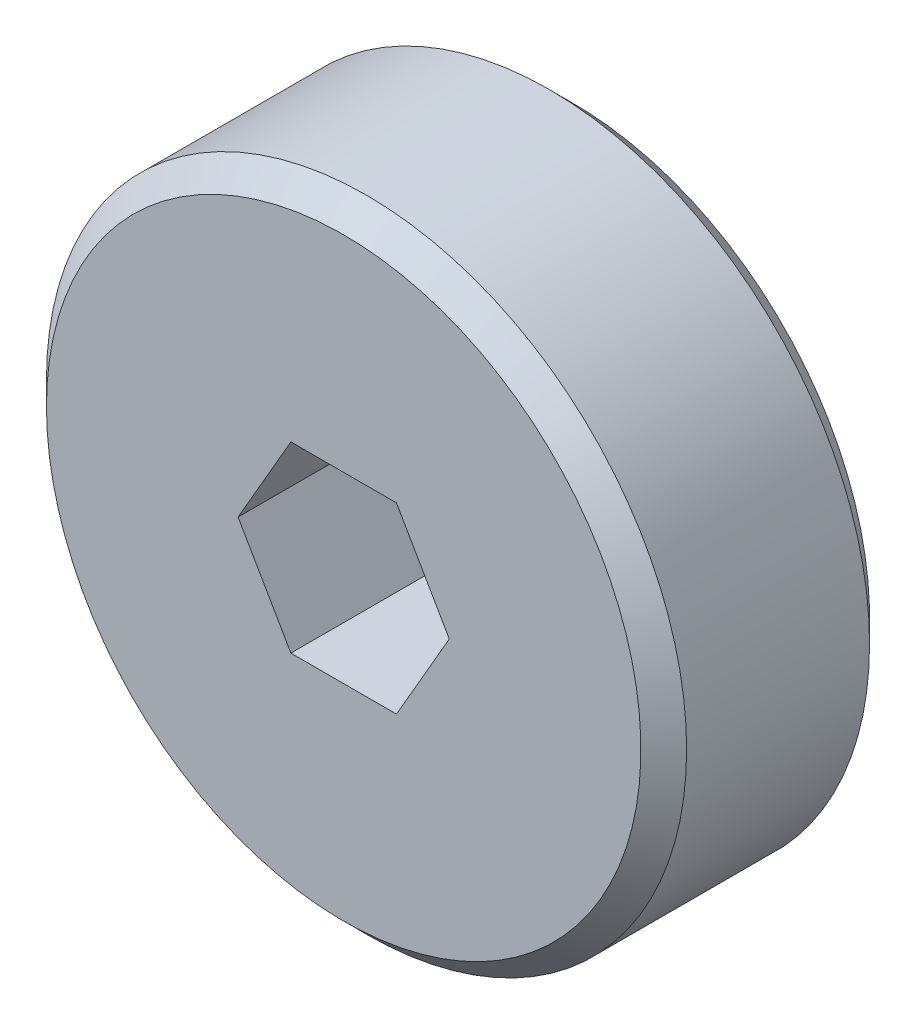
ISO-10303-21;
HEADER;
FILE_DESCRIPTION(('STEP AP214'),'2;1');
FILE_NAME('part.step','',(''),(''),'','','');
FILE_SCHEMA(('AUTOMOTIVE_DESIGN { 1 0 10303 214 1 1 1 1 }'));
ENDSEC;
DATA;
#1=APPLICATION_CONTEXT('core data for automotive mechanical design processes');
#2=APPLICATION_PROTOCOL_DEFINITION('international standard','automotive_design',2000,#1);
#3=PRODUCT_CONTEXT('',#1,'mechanical');
#4=PRODUCT('Part','Part','',(#3));
#5=PRODUCT_RELATED_PRODUCT_CATEGORY('part','',(#4));
#6=PRODUCT_DEFINITION_FORMATION('','',#4);
#7=PRODUCT_DEFINITION_CONTEXT('part definition',#1,'design');
#8=PRODUCT_DEFINITION('design','',#6,#7);
#9=PRODUCT_DEFINITION_SHAPE('','',#8);
#10=(LENGTH_UNIT() NAMED_UNIT(*) SI_UNIT(.MILLI.,.METRE.));
#11=(NAMED_UNIT(*) PLANE_ANGLE_UNIT() SI_UNIT($,.RADIAN.));
#12=(NAMED_UNIT(*) SI_UNIT($,.STERADIAN.) SOLID_ANGLE_UNIT());
#13=UNCERTAINTY_MEASURE_WITH_UNIT(LENGTH_MEASURE(1.E-05),#10,'distance_accuracy_value','');
#14=(GEOMETRIC_REPRESENTATION_CONTEXT(3) GLOBAL_UNCERTAINTY_ASSIGNED_CONTEXT((#13)) GLOBAL_UNIT_ASSIGNED_CONTEXT((#10,
#11,#12)) REPRESENTATION_CONTEXT('',''));
#15=CARTESIAN_POINT('',(0.,0.,0.));
#16=DIRECTION('',(0.,0.,1.));
#17=DIRECTION('',(1.,0.,0.));
#18=AXIS2_PLACEMENT_3D('',#15,#16,#17);
#19=CARTESIAN_POINT('',(0.,0.,0.));
#20=DIRECTION('',(0.,0.,1.));
#21=DIRECTION('',(1.,0.,0.));
#22=AXIS2_PLACEMENT_3D('',#19,#20,#21);
#23=PLANE('',#22);
#24=DIRECTION('',(-0.5,-0.866025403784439,0.));
#25=VECTOR('',#24,1.);
#26=CARTESIAN_POINT('',(3.66617420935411,0.,0.));
#27=LINE('',#26,#25);
#28=CARTESIAN_POINT('',(3.66617420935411,0.,0.));
#29=VERTEX_POINT('',#28);
#30=CARTESIAN_POINT('',(1.83308710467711,-3.175,0.));
#31=VERTEX_POINT('',#30);
#32=EDGE_CURVE('E147',#29,#31,#27,.T.);
#33=ORIENTED_EDGE('',*,*,#32,.F.);
#34=DIRECTION('',(0.5,-0.866025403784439,0.));
#35=VECTOR('',#34,1.);
#36=CARTESIAN_POINT('',(1.83308710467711,3.175,0.));
#37=LINE('',#36,#35);
#38=CARTESIAN_POINT('',(1.83308710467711,3.175,0.));
#39=VERTEX_POINT('',#38);
#40=EDGE_CURVE('E66',#39,#29,#37,.T.);
#41=ORIENTED_EDGE('',*,*,#40,.F.);
#42=DIRECTION('',(1.,0.,0.));
#43=VECTOR('',#42,1.);
#44=CARTESIAN_POINT('',(-1.83308710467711,3.175,0.));
#45=LINE('',#44,#43);
#46=CARTESIAN_POINT('',(-1.83308710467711,3.175,0.));
#47=VERTEX_POINT('',#46);
#48=EDGE_CURVE('E126',#47,#39,#45,.T.);
#49=ORIENTED_EDGE('',*,*,#48,.F.);
#50=DIRECTION('',(0.5,0.866025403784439,0.));
#51=VECTOR('',#50,1.);
#52=CARTESIAN_POINT('',(-3.66617420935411,0.,0.));
#53=LINE('',#52,#51);
#54=CARTESIAN_POINT('',(-3.66617420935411,0.,0.));
#55=VERTEX_POINT('',#54);
#56=EDGE_CURVE('E131',#55,#47,#53,.T.);
#57=ORIENTED_EDGE('',*,*,#56,.F.);
#58=DIRECTION('',(-0.5,0.866025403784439,0.));
#59=VECTOR('',#58,1.);
#60=CARTESIAN_POINT('',(-1.83308710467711,-3.175,0.));
#61=LINE('',#60,#59);
#62=CARTESIAN_POINT('',(-1.83308710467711,-3.175,0.));
#63=VERTEX_POINT('',#62);
#64=EDGE_CURVE('E154',#63,#55,#61,.T.);
#65=ORIENTED_EDGE('',*,*,#64,.F.);
#66=DIRECTION('',(-1.,0.,0.));
#67=VECTOR('',#66,1.);
#68=CARTESIAN_POINT('',(1.83308710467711,-3.175,0.));
#69=LINE('',#68,#67);
#70=EDGE_CURVE('E150',#31,#63,#69,.T.);
#71=ORIENTED_EDGE('',*,*,#70,.F.);
#72=EDGE_LOOP('',(#33,#41,#49,#57,#65,#71));
#73=FACE_BOUND('',#72,.T.);
#74=CARTESIAN_POINT('',(0.,0.,0.));
#75=DIRECTION('',(0.,0.,-1.));
#76=DIRECTION('',(-1.,0.,0.));
#77=AXIS2_PLACEMENT_3D('',#74,#75,#76);
#78=CIRCLE('',#77,10.31875);
#79=CARTESIAN_POINT('',(-10.31875,0.,0.));
#80=VERTEX_POINT('',#79);
#81=EDGE_CURVE('E11',#80,#80,#78,.T.);
#82=ORIENTED_EDGE('',*,*,#81,.T.);
#83=EDGE_LOOP('',(#82));
#84=FACE_BOUND('',#83,.T.);
#85=ADVANCED_FACE('F51',(#73,#84),#23,.F.);
#86=CARTESIAN_POINT('',(0.,0.,0.793749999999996));
#87=DIRECTION('',(0.,0.,1.));
#88=DIRECTION('',(1.,0.,0.));
#89=AXIS2_PLACEMENT_3D('',#86,#87,#88);
#90=CONICAL_SURFACE('',#89,11.1125,0.78539816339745);
#91=ORIENTED_EDGE('',*,*,#81,.F.);
#92=EDGE_LOOP('',(#91));
#93=FACE_BOUND('',#92,.T.);
#94=CARTESIAN_POINT('',(0.,0.,0.793749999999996));
#95=DIRECTION('',(0.,0.,-1.));
#96=DIRECTION('',(-1.,0.,0.));
#97=AXIS2_PLACEMENT_3D('',#94,#95,#96);
#98=CIRCLE('',#97,11.1125);
#99=CARTESIAN_POINT('',(-11.1125,0.,0.793749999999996));
#100=VERTEX_POINT('',#99);
#101=EDGE_CURVE('E59',#100,#100,#98,.T.);
#102=ORIENTED_EDGE('',*,*,#101,.T.);
#103=EDGE_LOOP('',(#102));
#104=FACE_BOUND('',#103,.T.);
#105=ADVANCED_FACE('F187',(#93,#104),#90,.T.);
#106=CARTESIAN_POINT('',(0.,0.,-10.585154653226));
#107=DIRECTION('',(0.,0.,-1.));
#108=DIRECTION('',(-1.,0.,0.));
#109=AXIS2_PLACEMENT_3D('',#106,#107,#108);
#110=CYLINDRICAL_SURFACE('',#109,11.1125);
#111=ORIENTED_EDGE('',*,*,#101,.F.);
#112=EDGE_LOOP('',(#111));
#113=FACE_BOUND('',#112,.T.);
#114=CARTESIAN_POINT('',(0.,0.,7.14374999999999));
#115=DIRECTION('',(0.,0.,-1.));
#116=DIRECTION('',(-1.,0.,0.));
#117=AXIS2_PLACEMENT_3D('',#114,#115,#116);
#118=CIRCLE('',#117,11.1125);
#119=CARTESIAN_POINT('',(-11.1125,0.,7.14374999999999));
#120=VERTEX_POINT('',#119);
#121=EDGE_CURVE('E179',#120,#120,#118,.T.);
#122=ORIENTED_EDGE('',*,*,#121,.T.);
#123=EDGE_LOOP('',(#122));
#124=FACE_BOUND('',#123,.T.);
#125=ADVANCED_FACE('F189',(#113,#124),#110,.T.);
#126=CARTESIAN_POINT('',(0.,0.,7.9375));
#127=DIRECTION('',(0.,0.,-1.));
#128=DIRECTION('',(-1.,0.,0.));
#129=AXIS2_PLACEMENT_3D('',#126,#127,#128);
#130=CONICAL_SURFACE('',#129,10.31875,0.785398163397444);
#131=ORIENTED_EDGE('',*,*,#121,.F.);
#132=EDGE_LOOP('',(#131));
#133=FACE_BOUND('',#132,.T.);
#134=CARTESIAN_POINT('',(0.,0.,7.9375));
#135=DIRECTION('',(0.,0.,-1.));
#136=DIRECTION('',(-1.,0.,0.));
#137=AXIS2_PLACEMENT_3D('',#134,#135,#136);
#138=CIRCLE('',#137,10.31875);
#139=CARTESIAN_POINT('',(-10.31875,0.,7.9375));
#140=VERTEX_POINT('',#139);
#141=EDGE_CURVE('E164',#140,#140,#138,.T.);
#142=ORIENTED_EDGE('',*,*,#141,.T.);
#143=EDGE_LOOP('',(#142));
#144=FACE_BOUND('',#143,.T.);
#145=ADVANCED_FACE('F192',(#133,#144),#130,.T.);
#146=CARTESIAN_POINT('',(-10.31875,0.,7.9375));
#147=DIRECTION('',(0.,0.,-1.));
#148=DIRECTION('',(-1.,0.,0.));
#149=AXIS2_PLACEMENT_3D('',#146,#147,#148);
#150=PLANE('',#149);
#151=DIRECTION('',(1.,0.,0.));
#152=VECTOR('',#151,1.);
#153=CARTESIAN_POINT('',(-1.83308710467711,3.175,7.9375));
#154=LINE('',#153,#152);
#155=CARTESIAN_POINT('',(-1.83308710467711,3.175,7.9375));
#156=VERTEX_POINT('',#155);
#157=CARTESIAN_POINT('',(1.83308710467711,3.175,7.9375));
#158=VERTEX_POINT('',#157);
#159=EDGE_CURVE('E113',#156,#158,#154,.T.);
#160=ORIENTED_EDGE('',*,*,#159,.T.);
#161=DIRECTION('',(0.5,-0.866025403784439,0.));
#162=VECTOR('',#161,1.);
#163=CARTESIAN_POINT('',(1.83308710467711,3.175,7.9375));
#164=LINE('',#163,#162);
#165=CARTESIAN_POINT('',(3.66617420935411,0.,7.9375));
#166=VERTEX_POINT('',#165);
#167=EDGE_CURVE('E106',#158,#166,#164,.T.);
#168=ORIENTED_EDGE('',*,*,#167,.T.);
#169=DIRECTION('',(-0.5,-0.866025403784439,0.));
#170=VECTOR('',#169,1.);
#171=CARTESIAN_POINT('',(3.66617420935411,0.,7.9375));
#172=LINE('',#171,#170);
#173=CARTESIAN_POINT('',(1.83308710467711,-3.175,7.9375));
#174=VERTEX_POINT('',#173);
#175=EDGE_CURVE('E116',#166,#174,#172,.T.);
#176=ORIENTED_EDGE('',*,*,#175,.T.);
#177=DIRECTION('',(-1.,0.,0.));
#178=VECTOR('',#177,1.);
#179=CARTESIAN_POINT('',(1.83308710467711,-3.175,7.9375));
#180=LINE('',#179,#178);
#181=CARTESIAN_POINT('',(-1.83308710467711,-3.175,7.9375));
#182=VERTEX_POINT('',#181);
#183=EDGE_CURVE('E74',#174,#182,#180,.T.);
#184=ORIENTED_EDGE('',*,*,#183,.T.);
#185=DIRECTION('',(-0.5,0.866025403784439,0.));
#186=VECTOR('',#185,1.);
#187=CARTESIAN_POINT('',(-1.83308710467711,-3.175,7.9375));
#188=LINE('',#187,#186);
#189=CARTESIAN_POINT('',(-3.66617420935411,0.,7.9375));
#190=VERTEX_POINT('',#189);
#191=EDGE_CURVE('E136',#182,#190,#188,.T.);
#192=ORIENTED_EDGE('',*,*,#191,.T.);
#193=DIRECTION('',(0.5,0.866025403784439,0.));
#194=VECTOR('',#193,1.);
#195=CARTESIAN_POINT('',(-3.66617420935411,0.,7.9375));
#196=LINE('',#195,#194);
#197=EDGE_CURVE('E140',#190,#156,#196,.T.);
#198=ORIENTED_EDGE('',*,*,#197,.T.);
#199=EDGE_LOOP('',(#160,#168,#176,#184,#192,#198));
#200=FACE_BOUND('',#199,.T.);
#201=ORIENTED_EDGE('',*,*,#141,.F.);
#202=EDGE_LOOP('',(#201));
#203=FACE_BOUND('',#202,.T.);
#204=ADVANCED_FACE('F121',(#200,#203),#150,.F.);
#205=CARTESIAN_POINT('',(1.83308710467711,3.175,7.9375));
#206=DIRECTION('',(0.866025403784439,0.5,0.));
#207=DIRECTION('',(-0.5,0.866025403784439,0.));
#208=AXIS2_PLACEMENT_3D('',#205,#206,#207);
#209=PLANE('',#208);
#210=ORIENTED_EDGE('',*,*,#40,.T.);
#211=DIRECTION('',(0.,0.,-1.));
#212=VECTOR('',#211,1.);
#213=CARTESIAN_POINT('',(3.66617420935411,0.,7.9375));
#214=LINE('',#213,#212);
#215=EDGE_CURVE('E102',#166,#29,#214,.T.);
#216=ORIENTED_EDGE('',*,*,#215,.F.);
#217=ORIENTED_EDGE('',*,*,#167,.F.);
#218=DIRECTION('',(0.,0.,-1.));
#219=VECTOR('',#218,1.);
#220=CARTESIAN_POINT('',(1.83308710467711,3.175,7.9375));
#221=LINE('',#220,#219);
#222=EDGE_CURVE('E161',#158,#39,#221,.T.);
#223=ORIENTED_EDGE('',*,*,#222,.T.);
#224=EDGE_LOOP('',(#210,#216,#217,#223));
#225=FACE_BOUND('',#224,.T.);
#226=ADVANCED_FACE('F104',(#225),#209,.F.);
#227=CARTESIAN_POINT('',(-1.83308710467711,3.175,7.9375));
#228=DIRECTION('',(0.,1.,0.));
#229=DIRECTION('',(-1.,0.,0.));
#230=AXIS2_PLACEMENT_3D('',#227,#228,#229);
#231=PLANE('',#230);
#232=ORIENTED_EDGE('',*,*,#48,.T.);
#233=ORIENTED_EDGE('',*,*,#222,.F.);
#234=ORIENTED_EDGE('',*,*,#159,.F.);
#235=DIRECTION('',(0.,0.,-1.));
#236=VECTOR('',#235,1.);
#237=CARTESIAN_POINT('',(-1.83308710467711,3.175,7.9375));
#238=LINE('',#237,#236);
#239=EDGE_CURVE('E165',#156,#47,#238,.T.);
#240=ORIENTED_EDGE('',*,*,#239,.T.);
#241=EDGE_LOOP('',(#232,#233,#234,#240));
#242=FACE_BOUND('',#241,.T.);
#243=ADVANCED_FACE('F206',(#242),#231,.F.);
#244=CARTESIAN_POINT('',(-3.66617420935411,0.,7.9375));
#245=DIRECTION('',(-0.866025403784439,0.5,0.));
#246=DIRECTION('',(-0.5,-0.866025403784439,0.));
#247=AXIS2_PLACEMENT_3D('',#244,#245,#246);
#248=PLANE('',#247);
#249=ORIENTED_EDGE('',*,*,#56,.T.);
#250=ORIENTED_EDGE('',*,*,#239,.F.);
#251=ORIENTED_EDGE('',*,*,#197,.F.);
#252=DIRECTION('',(0.,0.,-1.));
#253=VECTOR('',#252,1.);
#254=CARTESIAN_POINT('',(-3.66617420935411,0.,7.9375));
#255=LINE('',#254,#253);
#256=EDGE_CURVE('E168',#190,#55,#255,.T.);
#257=ORIENTED_EDGE('',*,*,#256,.T.);
#258=EDGE_LOOP('',(#249,#250,#251,#257));
#259=FACE_BOUND('',#258,.T.);
#260=ADVANCED_FACE('F227',(#259),#248,.F.);
#261=CARTESIAN_POINT('',(-1.83308710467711,-3.175,7.9375));
#262=DIRECTION('',(-0.866025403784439,-0.5,0.));
#263=DIRECTION('',(0.5,-0.866025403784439,0.));
#264=AXIS2_PLACEMENT_3D('',#261,#262,#263);
#265=PLANE('',#264);
#266=ORIENTED_EDGE('',*,*,#64,.T.);
#267=ORIENTED_EDGE('',*,*,#256,.F.);
#268=ORIENTED_EDGE('',*,*,#191,.F.);
#269=DIRECTION('',(0.,0.,-1.));
#270=VECTOR('',#269,1.);
#271=CARTESIAN_POINT('',(-1.83308710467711,-3.175,7.9375));
#272=LINE('',#271,#270);
#273=EDGE_CURVE('E171',#182,#63,#272,.T.);
#274=ORIENTED_EDGE('',*,*,#273,.T.);
#275=EDGE_LOOP('',(#266,#267,#268,#274));
#276=FACE_BOUND('',#275,.T.);
#277=ADVANCED_FACE('F224',(#276),#265,.F.);
#278=CARTESIAN_POINT('',(1.83308710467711,-3.175,7.9375));
#279=DIRECTION('',(0.,-1.,0.));
#280=DIRECTION('',(1.,0.,0.));
#281=AXIS2_PLACEMENT_3D('',#278,#279,#280);
#282=PLANE('',#281);
#283=ORIENTED_EDGE('',*,*,#70,.T.);
#284=ORIENTED_EDGE('',*,*,#273,.F.);
#285=ORIENTED_EDGE('',*,*,#183,.F.);
#286=DIRECTION('',(0.,0.,-1.));
#287=VECTOR('',#286,1.);
#288=CARTESIAN_POINT('',(1.83308710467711,-3.175,7.9375));
#289=LINE('',#288,#287);
#290=EDGE_CURVE('E112',#174,#31,#289,.T.);
#291=ORIENTED_EDGE('',*,*,#290,.T.);
#292=EDGE_LOOP('',(#283,#284,#285,#291));
#293=FACE_BOUND('',#292,.T.);
#294=ADVANCED_FACE('F221',(#293),#282,.F.);
#295=CARTESIAN_POINT('',(3.66617420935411,0.,7.9375));
#296=DIRECTION('',(0.866025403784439,-0.5,0.));
#297=DIRECTION('',(0.5,0.866025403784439,0.));
#298=AXIS2_PLACEMENT_3D('',#295,#296,#297);
#299=PLANE('',#298);
#300=ORIENTED_EDGE('',*,*,#32,.T.);
#301=ORIENTED_EDGE('',*,*,#290,.F.);
#302=ORIENTED_EDGE('',*,*,#175,.F.);
#303=ORIENTED_EDGE('',*,*,#215,.T.);
#304=EDGE_LOOP('',(#300,#301,#302,#303));
#305=FACE_BOUND('',#304,.T.);
#306=ADVANCED_FACE('F117',(#305),#299,.F.);
#307=CLOSED_SHELL('',(#85,#105,#125,#145,#204,#226,#243,#260,#277,#294,#306));
#308=MANIFOLD_SOLID_BREP('B2',#307);
#309=ADVANCED_BREP_SHAPE_REPRESENTATION('',(#18,#308),#14);
#310=SHAPE_DEFINITION_REPRESENTATION(#9,#309);
ENDSEC;
END-ISO-10303-21;
